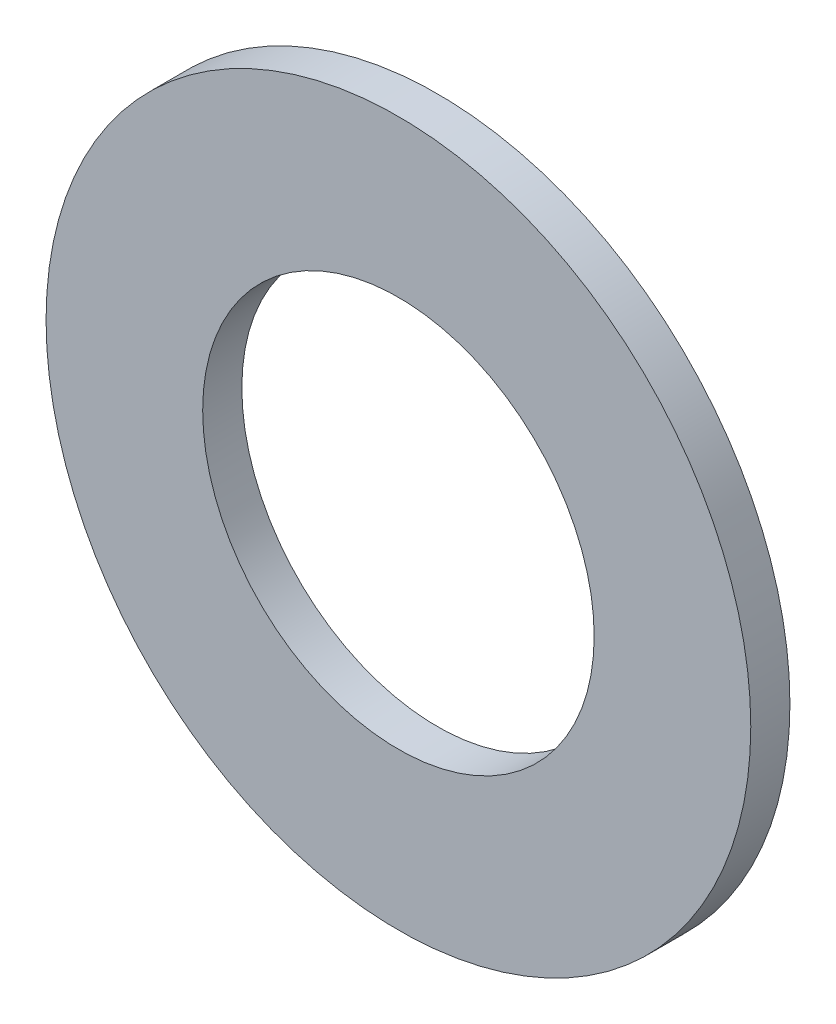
ISO-10303-21;
HEADER;
FILE_DESCRIPTION(('STEP AP214'),'2;1');
FILE_NAME('part.step','',(''),(''),'','','');
FILE_SCHEMA(('AUTOMOTIVE_DESIGN { 1 0 10303 214 1 1 1 1 }'));
ENDSEC;
DATA;
#1=APPLICATION_CONTEXT('core data for automotive mechanical design processes');
#2=APPLICATION_PROTOCOL_DEFINITION('international standard','automotive_design',2000,#1);
#3=PRODUCT_CONTEXT('',#1,'mechanical');
#4=PRODUCT('Part','Part','',(#3));
#5=PRODUCT_RELATED_PRODUCT_CATEGORY('part','',(#4));
#6=PRODUCT_DEFINITION_FORMATION('','',#4);
#7=PRODUCT_DEFINITION_CONTEXT('part definition',#1,'design');
#8=PRODUCT_DEFINITION('design','',#6,#7);
#9=PRODUCT_DEFINITION_SHAPE('','',#8);
#10=(LENGTH_UNIT() NAMED_UNIT(*) SI_UNIT(.MILLI.,.METRE.));
#11=(NAMED_UNIT(*) PLANE_ANGLE_UNIT() SI_UNIT($,.RADIAN.));
#12=(NAMED_UNIT(*) SI_UNIT($,.STERADIAN.) SOLID_ANGLE_UNIT());
#13=UNCERTAINTY_MEASURE_WITH_UNIT(LENGTH_MEASURE(1.E-05),#10,'distance_accuracy_value','');
#14=(GEOMETRIC_REPRESENTATION_CONTEXT(3) GLOBAL_UNCERTAINTY_ASSIGNED_CONTEXT((#13)) GLOBAL_UNIT_ASSIGNED_CONTEXT((#10,
#11,#12)) REPRESENTATION_CONTEXT('',''));
#15=CARTESIAN_POINT('',(0.,0.,0.));
#16=DIRECTION('',(0.,0.,1.));
#17=DIRECTION('',(1.,0.,0.));
#18=AXIS2_PLACEMENT_3D('',#15,#16,#17);
#19=CARTESIAN_POINT('',(0.,0.,2.));
#20=DIRECTION('',(0.,0.,-1.));
#21=DIRECTION('',(-1.,0.,0.));
#22=AXIS2_PLACEMENT_3D('',#19,#20,#21);
#23=CYLINDRICAL_SURFACE('',#22,18.);
#24=CARTESIAN_POINT('',(0.,0.,2.));
#25=DIRECTION('',(0.,0.,1.));
#26=DIRECTION('',(1.,0.,0.));
#27=AXIS2_PLACEMENT_3D('',#24,#25,#26);
#28=CIRCLE('',#27,18.);
#29=CARTESIAN_POINT('',(18.,0.,2.));
#30=VERTEX_POINT('',#29);
#31=EDGE_CURVE('E10',#30,#30,#28,.T.);
#32=ORIENTED_EDGE('',*,*,#31,.F.);
#33=EDGE_LOOP('',(#32));
#34=FACE_BOUND('',#33,.T.);
#35=CARTESIAN_POINT('',(0.,0.,0.));
#36=DIRECTION('',(0.,0.,1.));
#37=DIRECTION('',(1.,0.,0.));
#38=AXIS2_PLACEMENT_3D('',#35,#36,#37);
#39=CIRCLE('',#38,18.);
#40=CARTESIAN_POINT('',(18.,0.,0.));
#41=VERTEX_POINT('',#40);
#42=EDGE_CURVE('E36',#41,#41,#39,.T.);
#43=ORIENTED_EDGE('',*,*,#42,.T.);
#44=EDGE_LOOP('',(#43));
#45=FACE_BOUND('',#44,.T.);
#46=ADVANCED_FACE('F30',(#34,#45),#23,.T.);
#47=CARTESIAN_POINT('',(0.,0.,2.));
#48=DIRECTION('',(0.,0.,1.));
#49=DIRECTION('',(1.,0.,0.));
#50=AXIS2_PLACEMENT_3D('',#47,#48,#49);
#51=PLANE('',#50);
#52=CARTESIAN_POINT('',(0.,0.,2.));
#53=DIRECTION('',(0.,0.,1.));
#54=DIRECTION('',(1.,0.,0.));
#55=AXIS2_PLACEMENT_3D('',#52,#53,#54);
#56=CIRCLE('',#55,10.);
#57=CARTESIAN_POINT('',(10.,0.,2.));
#58=VERTEX_POINT('',#57);
#59=EDGE_CURVE('E44',#58,#58,#56,.T.);
#60=ORIENTED_EDGE('',*,*,#59,.F.);
#61=EDGE_LOOP('',(#60));
#62=FACE_BOUND('',#61,.T.);
#63=ORIENTED_EDGE('',*,*,#31,.T.);
#64=EDGE_LOOP('',(#63));
#65=FACE_BOUND('',#64,.T.);
#66=ADVANCED_FACE('F52',(#62,#65),#51,.T.);
#67=CARTESIAN_POINT('',(0.,0.,0.));
#68=DIRECTION('',(0.,0.,1.));
#69=DIRECTION('',(1.,0.,0.));
#70=AXIS2_PLACEMENT_3D('',#67,#68,#69);
#71=PLANE('',#70);
#72=CARTESIAN_POINT('',(0.,0.,0.));
#73=DIRECTION('',(0.,0.,1.));
#74=DIRECTION('',(1.,0.,0.));
#75=AXIS2_PLACEMENT_3D('',#72,#73,#74);
#76=CIRCLE('',#75,10.);
#77=CARTESIAN_POINT('',(10.,0.,0.));
#78=VERTEX_POINT('',#77);
#79=EDGE_CURVE('E40',#78,#78,#76,.T.);
#80=ORIENTED_EDGE('',*,*,#79,.T.);
#81=EDGE_LOOP('',(#80));
#82=FACE_BOUND('',#81,.T.);
#83=ORIENTED_EDGE('',*,*,#42,.F.);
#84=EDGE_LOOP('',(#83));
#85=FACE_BOUND('',#84,.T.);
#86=ADVANCED_FACE('F54',(#82,#85),#71,.F.);
#87=CARTESIAN_POINT('',(0.,0.,0.));
#88=DIRECTION('',(0.,0.,1.));
#89=DIRECTION('',(1.,0.,0.));
#90=AXIS2_PLACEMENT_3D('',#87,#88,#89);
#91=CYLINDRICAL_SURFACE('',#90,10.);
#92=ORIENTED_EDGE('',*,*,#79,.F.);
#93=EDGE_LOOP('',(#92));
#94=FACE_BOUND('',#93,.T.);
#95=ORIENTED_EDGE('',*,*,#59,.T.);
#96=EDGE_LOOP('',(#95));
#97=FACE_BOUND('',#96,.T.);
#98=ADVANCED_FACE('F50',(#94,#97),#91,.F.);
#99=CLOSED_SHELL('',(#46,#66,#86,#98));
#100=MANIFOLD_SOLID_BREP('B2',#99);
#101=ADVANCED_BREP_SHAPE_REPRESENTATION('',(#18,#100),#14);
#102=SHAPE_DEFINITION_REPRESENTATION(#9,#101);
ENDSEC;
END-ISO-10303-21;
